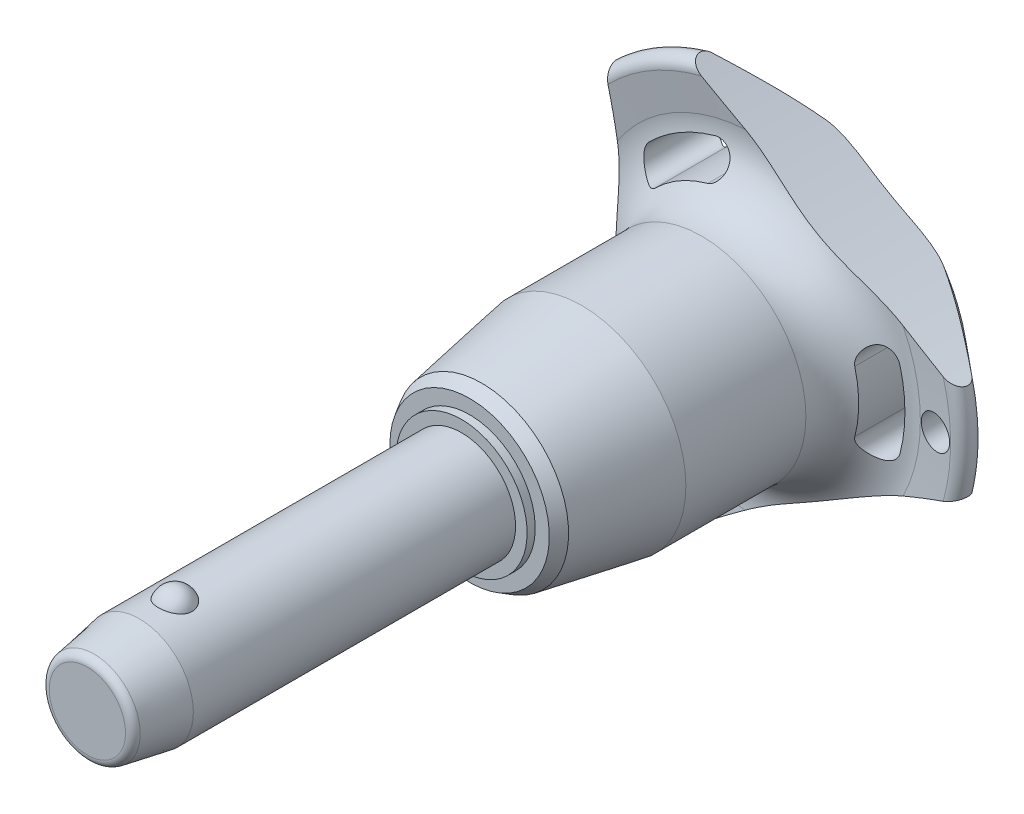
from build123d import *

# Parameters (mm, degrees)
SKETCH1_R           = 5
BOSS_EXTRUDE1_DEPTH = 25
SKETCH2_R           = 4.25
BOSS_EXTRUDE2_DEPTH = 33.3
BOSS_EXTRUDE3_START = 9.6
SKETCH1_2_R         = 5
BOSS_EXTRUDE3_DEPTH = 9.6
CHAMFER1_SIZE       = 4.8
CHAMFER1_SIZE2      = 0.846369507
FILLET1_R           = 0.75
SKETCH6_R           = 102.8
CUT_EXTRUDE1_DEPTH  = 65.557185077
CIRPATTERN1_COUNT   = 3
SKETCH7_R           = 1.5
CUT_EXTRUDE2_DEPTH  = 65.306162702


with BuildPart() as part:
    # Sketch1 → Boss-Extrude1 (new body)
    with BuildSketch(Plane.XY):
        Circle(SKETCH1_R)
    extrude(amount=-BOSS_EXTRUDE1_DEPTH)

    # Sketch2 → Boss-Extrude2 (add)
    with BuildSketch(Plane(origin=(0, 0, -25), x_dir=(-1, 0, 0), z_dir=(0, 0, -1))):
        Circle(SKETCH2_R)
    extrude(amount=BOSS_EXTRUDE2_DEPTH)

    # Sketch3 → Revolve1 (revolve)
    with BuildSketch(Plane(origin=(0, 0, 0), x_dir=(0, 0, -1), z_dir=(1, 0, 0))):
        with BuildLine():
            Line((-1.516575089, 6), (-1.516575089, 2.7))
            ThreePointArc((-1.516575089, 2.7), (0.133424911, 4.35), (-1.516575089, 6))
        make_face()
        with BuildLine():
            Line((-1.516575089, -2.7), (-1.516575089, -6))
            ThreePointArc((-1.516575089, -6), (0.133424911, -4.35), (-1.516575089, -2.7))
        make_face()
    revolve(axis=Axis((0, -2.7, 1.516575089), (0, 1, 0)))

    # Sketch1_2 → Boss-Extrude3 (add)
    with BuildSketch(Plane.XY.offset(BOSS_EXTRUDE3_START)):
        Circle(SKETCH1_2_R)
    extrude(amount=-BOSS_EXTRUDE3_DEPTH)

    # Chamfer1
    chamfer1_edges = [part.edges().sort_by_distance(p)[0] for p in [
        (-5, 0, 9.6),
    ]]
    chamfer1_side = [part.faces().sort_by_distance(p)[0] for p in [
        (-5, 0, -7.7),
    ]]
    chamfer(chamfer1_edges, length=CHAMFER1_SIZE, length2=CHAMFER1_SIZE2, reference=chamfer1_side[0])

    # Fillet1
    fillet1_edges = [part.edges().sort_by_distance(p)[0] for p in [
        (-4.153630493, 0, 9.6),
        (4.25, 0, -58.3),
    ]]
    fillet(fillet1_edges, radius=FILLET1_R)

    # Sketch4 → Revolve2 (revolve)
    with BuildSketch(Plane(origin=(0, 0, 0), x_dir=(0, 0, -1), z_dir=(1, 0, 0)), mode=Mode.PRIVATE) as revolve2_sk:
        Polygon((25, 0), (25, 6.067402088), (25.75, 6.067402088), (25.75, 7.371950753), (26.879772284, 8.024225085), (36.1, 9.65), (47.2, 9.65), (47.2, 0), align=None)
    revolve(revolve2_sk.sketch.rotate(Axis((0, 0, -47.2), (0, 0, 1)), 90), axis=Axis((0, 0, -47.2), (0, 0, 1)))

    # Sketch5 → Revolve3 (revolve)
    with BuildSketch(Plane(origin=(0, 0, 0), x_dir=(0, 0, -1), z_dir=(1, 0, 0)), mode=Mode.PRIVATE) as revolve3_sk:
        with BuildLine():
            Line((52.16082631, 15.274661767), (51.757834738, 18.475067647))
            ThreePointArc((51.757834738, 18.475067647), (52.349836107, 19.516443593), (53.516044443, 19.24278761))
            Line((53.516044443, 19.24278761), (57.835691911, 14.094832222))
            ThreePointArc((57.835691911, 14.094832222), (58.3, 12.689260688), (57.67067517, 11.349423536))
            ThreePointArc((57.67067517, 11.349423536), (54.033110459, 6.185112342), (52.75, 0))
            Line((52.75, 0), (47.2, 0))
            Line((47.2, 0), (47.2, 9.65))
            ThreePointArc((47.2, 9.65), (50.949887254, 11.342683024), (52.16082631, 15.274661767))
        make_face()
    revolve(revolve3_sk.sketch.rotate(Axis((0, 0, -52.75), (0, 0, 1)), 90), axis=Axis((0, 0, -52.75), (0, 0, 1)))

    # Sketch6 → Cut-Extrude1 (cut, through all)
    with BuildSketch(Plane.XY):
        with Locations((-115.2, 0)):
            Circle(SKETCH6_R)
        with BuildLine():
            ThreePointArc((13.411913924, -3.529271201), (13.868496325, 0), (13.411913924, 3.529271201))
            ThreePointArc((13.411913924, 3.529271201), (11.694200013, 4.531299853), (10.692171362, 2.813585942))
            ThreePointArc((10.692171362, 2.813585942), (11.056165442, 0), (10.692171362, -2.813585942))
            ThreePointArc((10.692171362, -2.813585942), (11.694200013, -4.531299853), (13.411913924, -3.529271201))
        make_face()
    cut_extrude1 = extrude(amount=-CUT_EXTRUDE1_DEPTH, mode=Mode.SUBTRACT)

    # CirPattern1: Cut-Extrude1 ×3 about axis
    cirpattern1_axis = Axis((0, 0, 0), (0, 0, 1))
    for i in range(1, CIRPATTERN1_COUNT):
        add(cut_extrude1.rotate(cirpattern1_axis, i * 360 / CIRPATTERN1_COUNT), mode=Mode.SUBTRACT)

    # Sketch7 → Cut-Extrude2 (cut, through all)
    with BuildSketch(Plane.XY):
        with Locations(Location((16.868496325, 0, 0), (0, 0, 225.467095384))):
            Circle(SKETCH7_R)
    extrude(amount=-CUT_EXTRUDE2_DEPTH, mode=Mode.SUBTRACT)


solid = part.part
